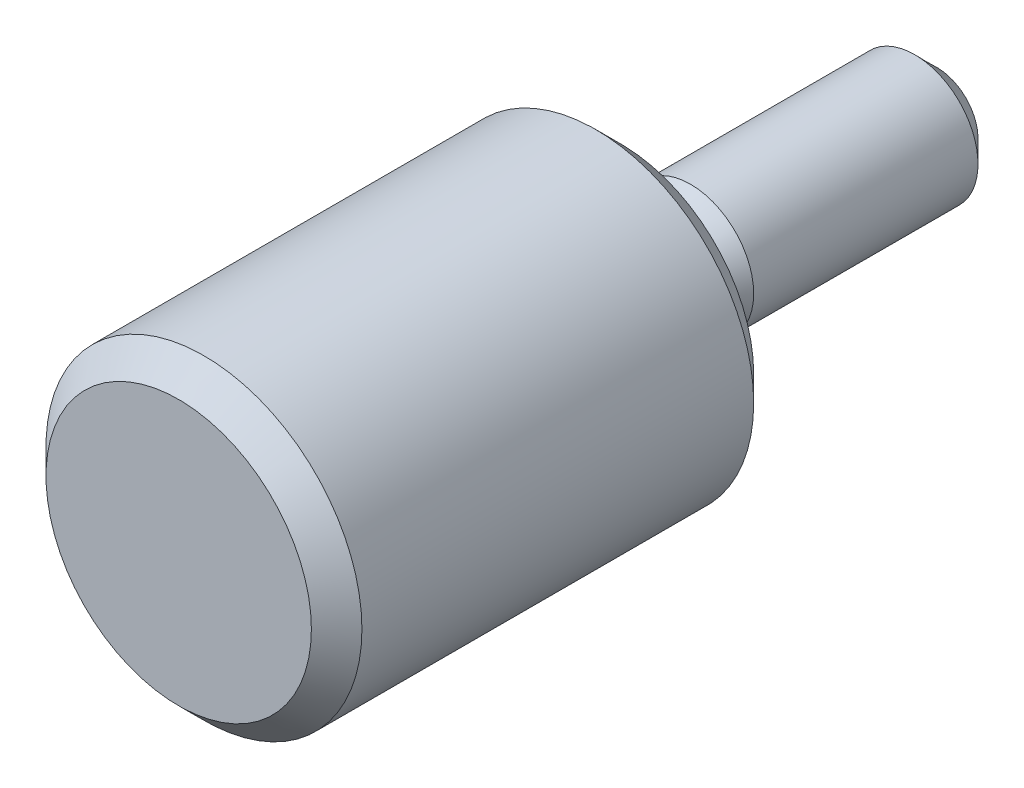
ISO-10303-21;
HEADER;
FILE_DESCRIPTION(('STEP AP214'),'2;1');
FILE_NAME('part.step','',(''),(''),'','','');
FILE_SCHEMA(('AUTOMOTIVE_DESIGN { 1 0 10303 214 1 1 1 1 }'));
ENDSEC;
DATA;
#1=APPLICATION_CONTEXT('core data for automotive mechanical design processes');
#2=APPLICATION_PROTOCOL_DEFINITION('international standard','automotive_design',2000,#1);
#3=PRODUCT_CONTEXT('',#1,'mechanical');
#4=PRODUCT('Part','Part','',(#3));
#5=PRODUCT_RELATED_PRODUCT_CATEGORY('part','',(#4));
#6=PRODUCT_DEFINITION_FORMATION('','',#4);
#7=PRODUCT_DEFINITION_CONTEXT('part definition',#1,'design');
#8=PRODUCT_DEFINITION('design','',#6,#7);
#9=PRODUCT_DEFINITION_SHAPE('','',#8);
#10=(LENGTH_UNIT() NAMED_UNIT(*) SI_UNIT(.MILLI.,.METRE.));
#11=(NAMED_UNIT(*) PLANE_ANGLE_UNIT() SI_UNIT($,.RADIAN.));
#12=(NAMED_UNIT(*) SI_UNIT($,.STERADIAN.) SOLID_ANGLE_UNIT());
#13=UNCERTAINTY_MEASURE_WITH_UNIT(LENGTH_MEASURE(1.E-05),#10,'distance_accuracy_value','');
#14=(GEOMETRIC_REPRESENTATION_CONTEXT(3) GLOBAL_UNCERTAINTY_ASSIGNED_CONTEXT((#13)) GLOBAL_UNIT_ASSIGNED_CONTEXT((#10,
#11,#12)) REPRESENTATION_CONTEXT('',''));
#15=CARTESIAN_POINT('',(0.,0.,0.));
#16=DIRECTION('',(0.,0.,1.));
#17=DIRECTION('',(1.,0.,0.));
#18=AXIS2_PLACEMENT_3D('',#15,#16,#17);
#19=CARTESIAN_POINT('',(0.,0.,8.));
#20=DIRECTION('',(0.,0.,-1.));
#21=DIRECTION('',(-1.,0.,0.));
#22=AXIS2_PLACEMENT_3D('',#19,#20,#21);
#23=CYLINDRICAL_SURFACE('',#22,2.);
#24=CARTESIAN_POINT('',(0.,0.,-9.3));
#25=DIRECTION('',(0.,0.,-1.));
#26=DIRECTION('',(-1.,0.,0.));
#27=AXIS2_PLACEMENT_3D('',#24,#25,#26);
#28=CIRCLE('',#27,2.);
#29=CARTESIAN_POINT('',(-2.,0.,-9.3));
#30=VERTEX_POINT('',#29);
#31=EDGE_CURVE('E8',#30,#30,#28,.F.);
#32=ORIENTED_EDGE('',*,*,#31,.T.);
#33=EDGE_LOOP('',(#32));
#34=FACE_BOUND('',#33,.T.);
#35=CARTESIAN_POINT('',(0.,0.,-2.2));
#36=DIRECTION('',(0.,0.,1.));
#37=DIRECTION('',(1.,0.,0.));
#38=AXIS2_PLACEMENT_3D('',#35,#36,#37);
#39=CIRCLE('',#38,2.);
#40=CARTESIAN_POINT('',(2.,0.,-2.2));
#41=VERTEX_POINT('',#40);
#42=EDGE_CURVE('E47',#41,#41,#39,.T.);
#43=ORIENTED_EDGE('',*,*,#42,.F.);
#44=EDGE_LOOP('',(#43));
#45=FACE_BOUND('',#44,.T.);
#46=ADVANCED_FACE('F12',(#34,#45),#23,.T.);
#47=CARTESIAN_POINT('',(0.,0.,14.));
#48=DIRECTION('',(0.,0.,-1.));
#49=DIRECTION('',(-1.,0.,0.));
#50=AXIS2_PLACEMENT_3D('',#47,#48,#49);
#51=CYLINDRICAL_SURFACE('',#50,5.);
#52=CARTESIAN_POINT('',(0.,0.,13.2));
#53=DIRECTION('',(0.,0.,1.));
#54=DIRECTION('',(1.,0.,0.));
#55=AXIS2_PLACEMENT_3D('',#52,#53,#54);
#56=CIRCLE('',#55,5.);
#57=CARTESIAN_POINT('',(5.,0.,13.2));
#58=VERTEX_POINT('',#57);
#59=EDGE_CURVE('E23',#58,#58,#56,.F.);
#60=ORIENTED_EDGE('',*,*,#59,.T.);
#61=EDGE_LOOP('',(#60));
#62=FACE_BOUND('',#61,.T.);
#63=CARTESIAN_POINT('',(0.,0.,0.8));
#64=DIRECTION('',(0.,0.,1.));
#65=DIRECTION('',(1.,0.,0.));
#66=AXIS2_PLACEMENT_3D('',#63,#64,#65);
#67=CIRCLE('',#66,5.);
#68=CARTESIAN_POINT('',(5.,0.,0.8));
#69=VERTEX_POINT('',#68);
#70=EDGE_CURVE('E35',#69,#69,#67,.T.);
#71=ORIENTED_EDGE('',*,*,#70,.T.);
#72=EDGE_LOOP('',(#71));
#73=FACE_BOUND('',#72,.T.);
#74=ADVANCED_FACE('F55',(#62,#73),#51,.T.);
#75=CARTESIAN_POINT('',(0.,0.,14.));
#76=DIRECTION('',(0.,0.,1.));
#77=DIRECTION('',(1.,0.,0.));
#78=AXIS2_PLACEMENT_3D('',#75,#76,#77);
#79=PLANE('',#78);
#80=CARTESIAN_POINT('',(0.,0.,14.));
#81=DIRECTION('',(0.,0.,1.));
#82=DIRECTION('',(1.,0.,0.));
#83=AXIS2_PLACEMENT_3D('',#80,#81,#82);
#84=CIRCLE('',#83,4.2);
#85=CARTESIAN_POINT('',(4.2,0.,14.));
#86=VERTEX_POINT('',#85);
#87=EDGE_CURVE('E27',#86,#86,#84,.T.);
#88=ORIENTED_EDGE('',*,*,#87,.T.);
#89=EDGE_LOOP('',(#88));
#90=FACE_BOUND('',#89,.T.);
#91=ADVANCED_FACE('F60',(#90),#79,.T.);
#92=CARTESIAN_POINT('',(0.,0.,0.));
#93=DIRECTION('',(0.,0.,1.));
#94=DIRECTION('',(1.,0.,0.));
#95=AXIS2_PLACEMENT_3D('',#92,#93,#94);
#96=PLANE('',#95);
#97=CARTESIAN_POINT('',(0.,0.,0.));
#98=DIRECTION('',(0.,0.,1.));
#99=DIRECTION('',(1.,0.,0.));
#100=AXIS2_PLACEMENT_3D('',#97,#98,#99);
#101=CIRCLE('',#100,4.2);
#102=CARTESIAN_POINT('',(4.2,0.,0.));
#103=VERTEX_POINT('',#102);
#104=EDGE_CURVE('E32',#103,#103,#101,.F.);
#105=ORIENTED_EDGE('',*,*,#104,.T.);
#106=EDGE_LOOP('',(#105));
#107=FACE_BOUND('',#106,.T.);
#108=CARTESIAN_POINT('',(0.,0.,0.));
#109=DIRECTION('',(0.,0.,1.));
#110=DIRECTION('',(1.,0.,0.));
#111=AXIS2_PLACEMENT_3D('',#108,#109,#110);
#112=CIRCLE('',#111,1.9);
#113=CARTESIAN_POINT('',(1.9,0.,0.));
#114=VERTEX_POINT('',#113);
#115=EDGE_CURVE('E44',#114,#114,#112,.T.);
#116=ORIENTED_EDGE('',*,*,#115,.T.);
#117=EDGE_LOOP('',(#116));
#118=FACE_BOUND('',#117,.T.);
#119=ADVANCED_FACE('F66',(#107,#118),#96,.F.);
#120=CARTESIAN_POINT('',(0.,0.,0.8));
#121=DIRECTION('',(0.,0.,1.));
#122=DIRECTION('',(1.,0.,0.));
#123=AXIS2_PLACEMENT_3D('',#120,#121,#122);
#124=CONICAL_SURFACE('',#123,5.,0.78539816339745);
#125=ORIENTED_EDGE('',*,*,#104,.F.);
#126=EDGE_LOOP('',(#125));
#127=FACE_BOUND('',#126,.T.);
#128=ORIENTED_EDGE('',*,*,#70,.F.);
#129=EDGE_LOOP('',(#128));
#130=FACE_BOUND('',#129,.T.);
#131=ADVANCED_FACE('F70',(#127,#130),#124,.T.);
#132=CARTESIAN_POINT('',(0.,0.,14.));
#133=DIRECTION('',(0.,0.,-1.));
#134=DIRECTION('',(-1.,0.,0.));
#135=AXIS2_PLACEMENT_3D('',#132,#133,#134);
#136=CONICAL_SURFACE('',#135,4.2,0.785398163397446);
#137=ORIENTED_EDGE('',*,*,#59,.F.);
#138=EDGE_LOOP('',(#137));
#139=FACE_BOUND('',#138,.T.);
#140=ORIENTED_EDGE('',*,*,#87,.F.);
#141=EDGE_LOOP('',(#140));
#142=FACE_BOUND('',#141,.T.);
#143=ADVANCED_FACE('F74',(#139,#142),#136,.T.);
#144=CARTESIAN_POINT('',(0.,0.,-1.21869474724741));
#145=DIRECTION('',(0.,0.,-1.));
#146=DIRECTION('',(-1.,0.,0.));
#147=AXIS2_PLACEMENT_3D('',#144,#145,#146);
#148=CONICAL_SURFACE('',#147,1.5,0.471238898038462);
#149=ORIENTED_EDGE('',*,*,#42,.T.);
#150=EDGE_LOOP('',(#149));
#151=FACE_BOUND('',#150,.T.);
#152=CARTESIAN_POINT('',(0.,0.,-1.21869474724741));
#153=DIRECTION('',(0.,0.,1.));
#154=DIRECTION('',(1.,0.,0.));
#155=AXIS2_PLACEMENT_3D('',#152,#153,#154);
#156=CIRCLE('',#155,1.5);
#157=CARTESIAN_POINT('',(1.5,0.,-1.21869474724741));
#158=VERTEX_POINT('',#157);
#159=EDGE_CURVE('E38',#158,#158,#156,.T.);
#160=ORIENTED_EDGE('',*,*,#159,.F.);
#161=EDGE_LOOP('',(#160));
#162=FACE_BOUND('',#161,.T.);
#163=ADVANCED_FACE('F51',(#151,#162),#148,.T.);
#164=CARTESIAN_POINT('',(0.,0.,0.));
#165=DIRECTION('',(0.,0.,1.));
#166=DIRECTION('',(1.,0.,0.));
#167=AXIS2_PLACEMENT_3D('',#164,#165,#166);
#168=CYLINDRICAL_SURFACE('',#167,1.5);
#169=ORIENTED_EDGE('',*,*,#159,.T.);
#170=EDGE_LOOP('',(#169));
#171=FACE_BOUND('',#170,.T.);
#172=CARTESIAN_POINT('',(0.,0.,-0.4));
#173=DIRECTION('',(0.,0.,1.));
#174=DIRECTION('',(1.,0.,0.));
#175=AXIS2_PLACEMENT_3D('',#172,#173,#174);
#176=CIRCLE('',#175,1.5);
#177=CARTESIAN_POINT('',(1.5,0.,-0.4));
#178=VERTEX_POINT('',#177);
#179=EDGE_CURVE('E41',#178,#178,#176,.T.);
#180=ORIENTED_EDGE('',*,*,#179,.F.);
#181=EDGE_LOOP('',(#180));
#182=FACE_BOUND('',#181,.T.);
#183=ADVANCED_FACE('F81',(#171,#182),#168,.T.);
#184=CARTESIAN_POINT('',(0.,0.,-0.4));
#185=DIRECTION('',(0.,0.,1.));
#186=DIRECTION('',(1.,0.,0.));
#187=AXIS2_PLACEMENT_3D('',#184,#185,#186);
#188=TOROIDAL_SURFACE('',#187,1.9,0.4);
#189=ORIENTED_EDGE('',*,*,#179,.T.);
#190=EDGE_LOOP('',(#189));
#191=FACE_BOUND('',#190,.T.);
#192=ORIENTED_EDGE('',*,*,#115,.F.);
#193=EDGE_LOOP('',(#192));
#194=FACE_BOUND('',#193,.T.);
#195=ADVANCED_FACE('F84',(#191,#194),#188,.F.);
#196=CARTESIAN_POINT('',(0.,0.,-10.));
#197=DIRECTION('',(0.,0.,-1.));
#198=DIRECTION('',(-1.,0.,0.));
#199=AXIS2_PLACEMENT_3D('',#196,#197,#198);
#200=PLANE('',#199);
#201=CARTESIAN_POINT('',(0.,0.,-10.));
#202=DIRECTION('',(0.,0.,-1.));
#203=DIRECTION('',(-1.,0.,0.));
#204=AXIS2_PLACEMENT_3D('',#201,#202,#203);
#205=CIRCLE('',#204,1.3);
#206=CARTESIAN_POINT('',(-1.3,0.,-10.));
#207=VERTEX_POINT('',#206);
#208=EDGE_CURVE('E19',#207,#207,#205,.T.);
#209=ORIENTED_EDGE('',*,*,#208,.T.);
#210=EDGE_LOOP('',(#209));
#211=FACE_BOUND('',#210,.T.);
#212=ADVANCED_FACE('F88',(#211),#200,.T.);
#213=CARTESIAN_POINT('',(0.,0.,-10.));
#214=DIRECTION('',(0.,0.,1.));
#215=DIRECTION('',(1.,0.,0.));
#216=AXIS2_PLACEMENT_3D('',#213,#214,#215);
#217=CONICAL_SURFACE('',#216,1.3,0.785398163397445);
#218=ORIENTED_EDGE('',*,*,#31,.F.);
#219=EDGE_LOOP('',(#218));
#220=FACE_BOUND('',#219,.T.);
#221=ORIENTED_EDGE('',*,*,#208,.F.);
#222=EDGE_LOOP('',(#221));
#223=FACE_BOUND('',#222,.T.);
#224=ADVANCED_FACE('F14',(#220,#223),#217,.T.);
#225=CLOSED_SHELL('',(#46,#74,#91,#119,#131,#143,#163,#183,#195,#212,#224));
#226=MANIFOLD_SOLID_BREP('B1',#225);
#227=ADVANCED_BREP_SHAPE_REPRESENTATION('',(#18,#226),#14);
#228=SHAPE_DEFINITION_REPRESENTATION(#9,#227);
ENDSEC;
END-ISO-10303-21;
